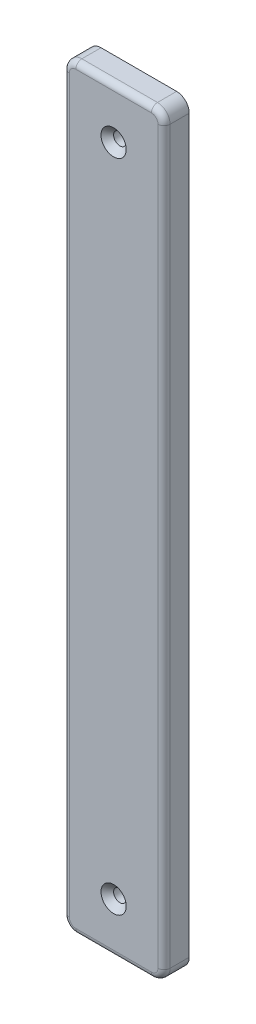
ISO-10303-21;
HEADER;
FILE_DESCRIPTION(('STEP AP214'),'2;1');
FILE_NAME('part.step','',(''),(''),'','','');
FILE_SCHEMA(('AUTOMOTIVE_DESIGN { 1 0 10303 214 1 1 1 1 }'));
ENDSEC;
DATA;
#1=APPLICATION_CONTEXT('core data for automotive mechanical design processes');
#2=APPLICATION_PROTOCOL_DEFINITION('international standard','automotive_design',2000,#1);
#3=PRODUCT_CONTEXT('',#1,'mechanical');
#4=PRODUCT('Part','Part','',(#3));
#5=PRODUCT_RELATED_PRODUCT_CATEGORY('part','',(#4));
#6=PRODUCT_DEFINITION_FORMATION('','',#4);
#7=PRODUCT_DEFINITION_CONTEXT('part definition',#1,'design');
#8=PRODUCT_DEFINITION('design','',#6,#7);
#9=PRODUCT_DEFINITION_SHAPE('','',#8);
#10=(LENGTH_UNIT() NAMED_UNIT(*) SI_UNIT(.MILLI.,.METRE.));
#11=(NAMED_UNIT(*) PLANE_ANGLE_UNIT() SI_UNIT($,.RADIAN.));
#12=(NAMED_UNIT(*) SI_UNIT($,.STERADIAN.) SOLID_ANGLE_UNIT());
#13=UNCERTAINTY_MEASURE_WITH_UNIT(LENGTH_MEASURE(1.E-05),#10,'distance_accuracy_value','');
#14=(GEOMETRIC_REPRESENTATION_CONTEXT(3) GLOBAL_UNCERTAINTY_ASSIGNED_CONTEXT((#13)) GLOBAL_UNIT_ASSIGNED_CONTEXT((#10,
#11,#12)) REPRESENTATION_CONTEXT('',''));
#15=CARTESIAN_POINT('',(0.,0.,0.));
#16=DIRECTION('',(0.,0.,1.));
#17=DIRECTION('',(1.,0.,0.));
#18=AXIS2_PLACEMENT_3D('',#15,#16,#17);
#19=CARTESIAN_POINT('',(25.4,-190.5,12.7));
#20=DIRECTION('',(-1.,0.,0.));
#21=DIRECTION('',(0.,0.,1.));
#22=AXIS2_PLACEMENT_3D('',#19,#20,#21);
#23=PLANE('',#22);
#24=DIRECTION('',(0.,0.,-1.));
#25=VECTOR('',#24,1.);
#26=CARTESIAN_POINT('',(25.4,184.15,12.7));
#27=LINE('',#26,#25);
#28=CARTESIAN_POINT('',(25.4,184.15,0.));
#29=VERTEX_POINT('',#28);
#30=CARTESIAN_POINT('',(25.4,184.15,9.652));
#31=VERTEX_POINT('',#30);
#32=EDGE_CURVE('E138',#29,#31,#27,.F.);
#33=ORIENTED_EDGE('',*,*,#32,.T.);
#34=DIRECTION('',(0.,1.,0.));
#35=VECTOR('',#34,1.);
#36=CARTESIAN_POINT('',(25.4,-190.5,9.652));
#37=LINE('',#36,#35);
#38=CARTESIAN_POINT('',(25.4,-184.15,9.652));
#39=VERTEX_POINT('',#38);
#40=EDGE_CURVE('E134',#31,#39,#37,.F.);
#41=ORIENTED_EDGE('',*,*,#40,.T.);
#42=DIRECTION('',(0.,0.,-1.));
#43=VECTOR('',#42,1.);
#44=CARTESIAN_POINT('',(25.4,-184.15,0.));
#45=LINE('',#44,#43);
#46=CARTESIAN_POINT('',(25.4,-184.15,0.));
#47=VERTEX_POINT('',#46);
#48=EDGE_CURVE('E127',#39,#47,#45,.T.);
#49=ORIENTED_EDGE('',*,*,#48,.T.);
#50=DIRECTION('',(0.,1.,0.));
#51=VECTOR('',#50,1.);
#52=CARTESIAN_POINT('',(25.4,-190.5,0.));
#53=LINE('',#52,#51);
#54=EDGE_CURVE('E131',#47,#29,#53,.T.);
#55=ORIENTED_EDGE('',*,*,#54,.T.);
#56=EDGE_LOOP('',(#33,#41,#49,#55));
#57=FACE_BOUND('',#56,.T.);
#58=ADVANCED_FACE('F36',(#57),#23,.F.);
#59=CARTESIAN_POINT('',(-25.4,190.5,12.7));
#60=DIRECTION('',(0.,1.,0.));
#61=DIRECTION('',(0.,0.,1.));
#62=AXIS2_PLACEMENT_3D('',#59,#60,#61);
#63=PLANE('',#62);
#64=DIRECTION('',(0.,0.,-1.));
#65=VECTOR('',#64,1.);
#66=CARTESIAN_POINT('',(-19.05,190.5,12.7));
#67=LINE('',#66,#65);
#68=CARTESIAN_POINT('',(-19.05,190.5,0.));
#69=VERTEX_POINT('',#68);
#70=CARTESIAN_POINT('',(-19.05,190.5,9.652));
#71=VERTEX_POINT('',#70);
#72=EDGE_CURVE('E198',#69,#71,#67,.F.);
#73=ORIENTED_EDGE('',*,*,#72,.T.);
#74=DIRECTION('',(1.,0.,0.));
#75=VECTOR('',#74,1.);
#76=CARTESIAN_POINT('',(19.05,190.5,9.652));
#77=LINE('',#76,#75);
#78=CARTESIAN_POINT('',(19.05,190.5,9.652));
#79=VERTEX_POINT('',#78);
#80=EDGE_CURVE('E221',#71,#79,#77,.T.);
#81=ORIENTED_EDGE('',*,*,#80,.T.);
#82=DIRECTION('',(0.,0.,-1.));
#83=VECTOR('',#82,1.);
#84=CARTESIAN_POINT('',(19.05,190.5,0.));
#85=LINE('',#84,#83);
#86=CARTESIAN_POINT('',(19.05,190.5,0.));
#87=VERTEX_POINT('',#86);
#88=EDGE_CURVE('E196',#79,#87,#85,.T.);
#89=ORIENTED_EDGE('',*,*,#88,.T.);
#90=DIRECTION('',(1.,0.,0.));
#91=VECTOR('',#90,1.);
#92=CARTESIAN_POINT('',(-25.4,190.5,0.));
#93=LINE('',#92,#91);
#94=EDGE_CURVE('E154',#69,#87,#93,.T.);
#95=ORIENTED_EDGE('',*,*,#94,.F.);
#96=EDGE_LOOP('',(#73,#81,#89,#95));
#97=FACE_BOUND('',#96,.T.);
#98=ADVANCED_FACE('F275',(#97),#63,.T.);
#99=CARTESIAN_POINT('',(-25.4,190.5,12.7));
#100=DIRECTION('',(1.,0.,0.));
#101=DIRECTION('',(0.,0.,-1.));
#102=AXIS2_PLACEMENT_3D('',#99,#100,#101);
#103=PLANE('',#102);
#104=DIRECTION('',(0.,0.,-1.));
#105=VECTOR('',#104,1.);
#106=CARTESIAN_POINT('',(-25.4,-184.15,12.7));
#107=LINE('',#106,#105);
#108=CARTESIAN_POINT('',(-25.4,-184.15,0.));
#109=VERTEX_POINT('',#108);
#110=CARTESIAN_POINT('',(-25.4,-184.15,9.652));
#111=VERTEX_POINT('',#110);
#112=EDGE_CURVE('E194',#109,#111,#107,.F.);
#113=ORIENTED_EDGE('',*,*,#112,.T.);
#114=DIRECTION('',(0.,-1.,0.));
#115=VECTOR('',#114,1.);
#116=CARTESIAN_POINT('',(-25.4,190.5,9.652));
#117=LINE('',#116,#115);
#118=CARTESIAN_POINT('',(-25.4,184.15,9.652));
#119=VERTEX_POINT('',#118);
#120=EDGE_CURVE('E11',#111,#119,#117,.F.);
#121=ORIENTED_EDGE('',*,*,#120,.T.);
#122=DIRECTION('',(0.,0.,-1.));
#123=VECTOR('',#122,1.);
#124=CARTESIAN_POINT('',(-25.4,184.15,0.));
#125=LINE('',#124,#123);
#126=CARTESIAN_POINT('',(-25.4,184.15,0.));
#127=VERTEX_POINT('',#126);
#128=EDGE_CURVE('E192',#119,#127,#125,.T.);
#129=ORIENTED_EDGE('',*,*,#128,.T.);
#130=DIRECTION('',(0.,-1.,0.));
#131=VECTOR('',#130,1.);
#132=CARTESIAN_POINT('',(-25.4,190.5,0.));
#133=LINE('',#132,#131);
#134=EDGE_CURVE('E160',#127,#109,#133,.T.);
#135=ORIENTED_EDGE('',*,*,#134,.T.);
#136=EDGE_LOOP('',(#113,#121,#129,#135));
#137=FACE_BOUND('',#136,.T.);
#138=ADVANCED_FACE('F280',(#137),#103,.F.);
#139=CARTESIAN_POINT('',(25.4,-190.5,12.7));
#140=DIRECTION('',(0.,-1.,0.));
#141=DIRECTION('',(0.,0.,-1.));
#142=AXIS2_PLACEMENT_3D('',#139,#140,#141);
#143=PLANE('',#142);
#144=DIRECTION('',(0.,0.,-1.));
#145=VECTOR('',#144,1.);
#146=CARTESIAN_POINT('',(19.05,-190.5,12.7));
#147=LINE('',#146,#145);
#148=CARTESIAN_POINT('',(19.05,-190.5,0.));
#149=VERTEX_POINT('',#148);
#150=CARTESIAN_POINT('',(19.05,-190.5,9.652));
#151=VERTEX_POINT('',#150);
#152=EDGE_CURVE('E143',#149,#151,#147,.F.);
#153=ORIENTED_EDGE('',*,*,#152,.T.);
#154=DIRECTION('',(-1.,0.,0.));
#155=VECTOR('',#154,1.);
#156=CARTESIAN_POINT('',(-19.05,-190.5,9.652));
#157=LINE('',#156,#155);
#158=CARTESIAN_POINT('',(-19.05,-190.5,9.652));
#159=VERTEX_POINT('',#158);
#160=EDGE_CURVE('E60',#151,#159,#157,.T.);
#161=ORIENTED_EDGE('',*,*,#160,.T.);
#162=DIRECTION('',(0.,0.,-1.));
#163=VECTOR('',#162,1.);
#164=CARTESIAN_POINT('',(-19.05,-190.5,0.));
#165=LINE('',#164,#163);
#166=CARTESIAN_POINT('',(-19.05,-190.5,0.));
#167=VERTEX_POINT('',#166);
#168=EDGE_CURVE('E147',#159,#167,#165,.T.);
#169=ORIENTED_EDGE('',*,*,#168,.T.);
#170=DIRECTION('',(-1.,0.,0.));
#171=VECTOR('',#170,1.);
#172=CARTESIAN_POINT('',(25.4,-190.5,0.));
#173=LINE('',#172,#171);
#174=EDGE_CURVE('E170',#149,#167,#173,.T.);
#175=ORIENTED_EDGE('',*,*,#174,.F.);
#176=EDGE_LOOP('',(#153,#161,#169,#175));
#177=FACE_BOUND('',#176,.T.);
#178=ADVANCED_FACE('F358',(#177),#143,.T.);
#179=CARTESIAN_POINT('',(25.4,190.5,12.7));
#180=DIRECTION('',(0.,0.,-1.));
#181=DIRECTION('',(-1.,0.,0.));
#182=AXIS2_PLACEMENT_3D('',#179,#180,#181);
#183=PLANE('',#182);
#184=DIRECTION('',(1.,0.,0.));
#185=VECTOR('',#184,1.);
#186=CARTESIAN_POINT('',(-19.05,187.452,12.7));
#187=LINE('',#186,#185);
#188=CARTESIAN_POINT('',(19.05,187.452,12.7));
#189=VERTEX_POINT('',#188);
#190=CARTESIAN_POINT('',(-19.05,187.452,12.7));
#191=VERTEX_POINT('',#190);
#192=EDGE_CURVE('E213',#189,#191,#187,.F.);
#193=ORIENTED_EDGE('',*,*,#192,.T.);
#194=CARTESIAN_POINT('',(-19.05,184.15,12.7));
#195=DIRECTION('',(0.,0.,-1.));
#196=DIRECTION('',(-1.,0.,0.));
#197=AXIS2_PLACEMENT_3D('',#194,#195,#196);
#198=CIRCLE('',#197,3.302);
#199=CARTESIAN_POINT('',(-22.352,184.15,12.7));
#200=VERTEX_POINT('',#199);
#201=EDGE_CURVE('E215',#191,#200,#198,.F.);
#202=ORIENTED_EDGE('',*,*,#201,.T.);
#203=DIRECTION('',(0.,-1.,0.));
#204=VECTOR('',#203,1.);
#205=CARTESIAN_POINT('',(-22.352,190.5,12.7));
#206=LINE('',#205,#204);
#207=CARTESIAN_POINT('',(-22.352,-184.15,12.7));
#208=VERTEX_POINT('',#207);
#209=EDGE_CURVE('E201',#200,#208,#206,.T.);
#210=ORIENTED_EDGE('',*,*,#209,.T.);
#211=CARTESIAN_POINT('',(-19.05,-184.15,12.7));
#212=DIRECTION('',(0.,0.,-1.));
#213=DIRECTION('',(-1.,0.,0.));
#214=AXIS2_PLACEMENT_3D('',#211,#212,#213);
#215=CIRCLE('',#214,3.302);
#216=CARTESIAN_POINT('',(-19.05,-187.452,12.7));
#217=VERTEX_POINT('',#216);
#218=EDGE_CURVE('E203',#208,#217,#215,.F.);
#219=ORIENTED_EDGE('',*,*,#218,.T.);
#220=DIRECTION('',(-1.,0.,0.));
#221=VECTOR('',#220,1.);
#222=CARTESIAN_POINT('',(19.05,-187.452,12.7));
#223=LINE('',#222,#221);
#224=CARTESIAN_POINT('',(19.05,-187.452,12.7));
#225=VERTEX_POINT('',#224);
#226=EDGE_CURVE('E205',#217,#225,#223,.F.);
#227=ORIENTED_EDGE('',*,*,#226,.T.);
#228=CARTESIAN_POINT('',(19.05,-184.15,12.7));
#229=DIRECTION('',(0.,0.,-1.));
#230=DIRECTION('',(-1.,0.,0.));
#231=AXIS2_PLACEMENT_3D('',#228,#229,#230);
#232=CIRCLE('',#231,3.302);
#233=CARTESIAN_POINT('',(22.352,-184.15,12.7));
#234=VERTEX_POINT('',#233);
#235=EDGE_CURVE('E207',#225,#234,#232,.F.);
#236=ORIENTED_EDGE('',*,*,#235,.T.);
#237=DIRECTION('',(0.,1.,0.));
#238=VECTOR('',#237,1.);
#239=CARTESIAN_POINT('',(22.352,190.5,12.7));
#240=LINE('',#239,#238);
#241=CARTESIAN_POINT('',(22.352,184.15,12.7));
#242=VERTEX_POINT('',#241);
#243=EDGE_CURVE('E209',#234,#242,#240,.T.);
#244=ORIENTED_EDGE('',*,*,#243,.T.);
#245=CARTESIAN_POINT('',(19.05,184.15,12.7));
#246=DIRECTION('',(0.,0.,-1.));
#247=DIRECTION('',(-1.,0.,0.));
#248=AXIS2_PLACEMENT_3D('',#245,#246,#247);
#249=CIRCLE('',#248,3.302);
#250=EDGE_CURVE('E211',#242,#189,#249,.F.);
#251=ORIENTED_EDGE('',*,*,#250,.T.);
#252=EDGE_LOOP('',(#193,#202,#210,#219,#227,#236,#244,#251));
#253=FACE_BOUND('',#252,.T.);
#254=CARTESIAN_POINT('',(0.,165.1,12.7));
#255=DIRECTION('',(0.,0.,-1.));
#256=DIRECTION('',(-1.,0.,0.));
#257=AXIS2_PLACEMENT_3D('',#254,#255,#256);
#258=CIRCLE('',#257,6.34999999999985);
#259=CARTESIAN_POINT('',(6.3499999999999,165.1,12.7));
#260=VERTEX_POINT('',#259);
#261=EDGE_CURVE('E179',#260,#260,#258,.T.);
#262=ORIENTED_EDGE('',*,*,#261,.T.);
#263=EDGE_LOOP('',(#262));
#264=FACE_BOUND('',#263,.T.);
#265=CARTESIAN_POINT('',(0.,-165.1,12.7));
#266=DIRECTION('',(0.,0.,-1.));
#267=DIRECTION('',(-1.,0.,0.));
#268=AXIS2_PLACEMENT_3D('',#265,#266,#267);
#269=CIRCLE('',#268,6.34999999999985);
#270=CARTESIAN_POINT('',(6.3499999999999,-165.1,12.7));
#271=VERTEX_POINT('',#270);
#272=EDGE_CURVE('E176',#271,#271,#269,.T.);
#273=ORIENTED_EDGE('',*,*,#272,.T.);
#274=EDGE_LOOP('',(#273));
#275=FACE_BOUND('',#274,.T.);
#276=ADVANCED_FACE('F355',(#253,#264,#275),#183,.F.);
#277=CARTESIAN_POINT('',(25.4,190.5,0.));
#278=DIRECTION('',(0.,0.,-1.));
#279=DIRECTION('',(-1.,0.,0.));
#280=AXIS2_PLACEMENT_3D('',#277,#278,#279);
#281=PLANE('',#280);
#282=CARTESIAN_POINT('',(0.,165.1,0.));
#283=DIRECTION('',(0.,0.,1.));
#284=DIRECTION('',(1.,0.,0.));
#285=AXIS2_PLACEMENT_3D('',#282,#283,#284);
#286=CIRCLE('',#285,3.17499999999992);
#287=CARTESIAN_POINT('',(3.17499999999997,165.1,0.));
#288=VERTEX_POINT('',#287);
#289=EDGE_CURVE('E163',#288,#288,#286,.T.);
#290=ORIENTED_EDGE('',*,*,#289,.T.);
#291=EDGE_LOOP('',(#290));
#292=FACE_BOUND('',#291,.T.);
#293=CARTESIAN_POINT('',(0.,-165.1,0.));
#294=DIRECTION('',(0.,0.,1.));
#295=DIRECTION('',(1.,0.,0.));
#296=AXIS2_PLACEMENT_3D('',#293,#294,#295);
#297=CIRCLE('',#296,3.17499999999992);
#298=CARTESIAN_POINT('',(3.17499999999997,-165.1,0.));
#299=VERTEX_POINT('',#298);
#300=EDGE_CURVE('E155',#299,#299,#297,.T.);
#301=ORIENTED_EDGE('',*,*,#300,.T.);
#302=EDGE_LOOP('',(#301));
#303=FACE_BOUND('',#302,.T.);
#304=ORIENTED_EDGE('',*,*,#54,.F.);
#305=CARTESIAN_POINT('',(19.05,-184.15,0.));
#306=DIRECTION('',(0.,0.,-1.));
#307=DIRECTION('',(-1.,0.,0.));
#308=AXIS2_PLACEMENT_3D('',#305,#306,#307);
#309=CIRCLE('',#308,6.35);
#310=EDGE_CURVE('E141',#47,#149,#309,.T.);
#311=ORIENTED_EDGE('',*,*,#310,.T.);
#312=ORIENTED_EDGE('',*,*,#174,.T.);
#313=CARTESIAN_POINT('',(-19.05,-184.15,0.));
#314=DIRECTION('',(0.,0.,-1.));
#315=DIRECTION('',(-1.,0.,0.));
#316=AXIS2_PLACEMENT_3D('',#313,#314,#315);
#317=CIRCLE('',#316,6.35);
#318=EDGE_CURVE('E148',#167,#109,#317,.T.);
#319=ORIENTED_EDGE('',*,*,#318,.T.);
#320=ORIENTED_EDGE('',*,*,#134,.F.);
#321=CARTESIAN_POINT('',(-19.05,184.15,0.));
#322=DIRECTION('',(0.,0.,-1.));
#323=DIRECTION('',(-1.,0.,0.));
#324=AXIS2_PLACEMENT_3D('',#321,#322,#323);
#325=CIRCLE('',#324,6.35);
#326=EDGE_CURVE('E187',#127,#69,#325,.T.);
#327=ORIENTED_EDGE('',*,*,#326,.T.);
#328=ORIENTED_EDGE('',*,*,#94,.T.);
#329=CARTESIAN_POINT('',(19.05,184.15,0.));
#330=DIRECTION('',(0.,0.,-1.));
#331=DIRECTION('',(-1.,0.,0.));
#332=AXIS2_PLACEMENT_3D('',#329,#330,#331);
#333=CIRCLE('',#332,6.35);
#334=EDGE_CURVE('E137',#87,#29,#333,.T.);
#335=ORIENTED_EDGE('',*,*,#334,.T.);
#336=EDGE_LOOP('',(#304,#311,#312,#319,#320,#327,#328,#335));
#337=FACE_BOUND('',#336,.T.);
#338=ADVANCED_FACE('F150',(#292,#303,#337),#281,.T.);
#339=CARTESIAN_POINT('',(0.,-165.1,0.));
#340=DIRECTION('',(0.,0.,1.));
#341=DIRECTION('',(1.,0.,0.));
#342=AXIS2_PLACEMENT_3D('',#339,#340,#341);
#343=CYLINDRICAL_SURFACE('',#342,3.17499999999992);
#344=CARTESIAN_POINT('',(0.,-165.1,9.52500000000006));
#345=DIRECTION('',(0.,0.,-1.));
#346=DIRECTION('',(-1.,0.,0.));
#347=AXIS2_PLACEMENT_3D('',#344,#345,#346);
#348=CIRCLE('',#347,3.17499999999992);
#349=CARTESIAN_POINT('',(3.17499999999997,-165.1,9.52500000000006));
#350=VERTEX_POINT('',#349);
#351=EDGE_CURVE('E182',#350,#350,#348,.F.);
#352=ORIENTED_EDGE('',*,*,#351,.T.);
#353=EDGE_LOOP('',(#352));
#354=FACE_BOUND('',#353,.T.);
#355=ORIENTED_EDGE('',*,*,#300,.F.);
#356=EDGE_LOOP('',(#355));
#357=FACE_BOUND('',#356,.T.);
#358=ADVANCED_FACE('F262',(#354,#357),#343,.F.);
#359=CARTESIAN_POINT('',(0.,165.1,0.));
#360=DIRECTION('',(0.,0.,1.));
#361=DIRECTION('',(1.,0.,0.));
#362=AXIS2_PLACEMENT_3D('',#359,#360,#361);
#363=CYLINDRICAL_SURFACE('',#362,3.17499999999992);
#364=CARTESIAN_POINT('',(0.,165.1,9.52500000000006));
#365=DIRECTION('',(0.,0.,-1.));
#366=DIRECTION('',(-1.,0.,0.));
#367=AXIS2_PLACEMENT_3D('',#364,#365,#366);
#368=CIRCLE('',#367,3.17499999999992);
#369=CARTESIAN_POINT('',(3.17499999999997,165.1,9.52500000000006));
#370=VERTEX_POINT('',#369);
#371=EDGE_CURVE('E173',#370,#370,#368,.F.);
#372=ORIENTED_EDGE('',*,*,#371,.T.);
#373=EDGE_LOOP('',(#372));
#374=FACE_BOUND('',#373,.T.);
#375=ORIENTED_EDGE('',*,*,#289,.F.);
#376=EDGE_LOOP('',(#375));
#377=FACE_BOUND('',#376,.T.);
#378=ADVANCED_FACE('F259',(#374,#377),#363,.F.);
#379=CARTESIAN_POINT('',(0.,165.1,9.52500000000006));
#380=DIRECTION('',(0.,0.,1.));
#381=DIRECTION('',(1.,0.,0.));
#382=AXIS2_PLACEMENT_3D('',#379,#380,#381);
#383=CONICAL_SURFACE('',#382,3.17499999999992,0.785398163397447);
#384=CARTESIAN_POINT('',(6.3499999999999,165.1,12.7));
#385=CARTESIAN_POINT('',(6.31692708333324,165.1,12.6669270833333));
#386=CARTESIAN_POINT('',(6.28385416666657,165.1,12.6338541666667));
#387=CARTESIAN_POINT('',(6.21770833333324,165.1,12.5677083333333));
#388=CARTESIAN_POINT('',(6.18463541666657,165.1,12.5346354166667));
#389=CARTESIAN_POINT('',(6.11848958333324,165.1,12.4684895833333));
#390=CARTESIAN_POINT('',(6.08541666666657,165.1,12.4354166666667));
#391=CARTESIAN_POINT('',(6.01927083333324,165.1,12.3692708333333));
#392=CARTESIAN_POINT('',(5.98619791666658,165.1,12.3361979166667));
#393=CARTESIAN_POINT('',(5.92005208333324,165.1,12.2700520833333));
#394=CARTESIAN_POINT('',(5.88697916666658,165.1,12.2369791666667));
#395=CARTESIAN_POINT('',(5.82083333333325,165.1,12.1708333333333));
#396=CARTESIAN_POINT('',(5.78776041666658,165.1,12.1377604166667));
#397=CARTESIAN_POINT('',(5.72161458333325,165.1,12.0716145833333));
#398=CARTESIAN_POINT('',(5.68854166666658,165.1,12.0385416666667));
#399=CARTESIAN_POINT('',(5.62239583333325,165.1,11.9723958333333));
#400=CARTESIAN_POINT('',(5.58932291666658,165.1,11.9393229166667));
#401=CARTESIAN_POINT('',(5.52317708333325,165.1,11.8731770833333));
#402=CARTESIAN_POINT('',(5.49010416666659,165.1,11.8401041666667));
#403=CARTESIAN_POINT('',(5.42395833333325,165.1,11.7739583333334));
#404=CARTESIAN_POINT('',(5.39088541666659,165.1,11.7408854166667));
#405=CARTESIAN_POINT('',(5.32473958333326,165.1,11.6747395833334));
#406=CARTESIAN_POINT('',(5.29166666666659,165.1,11.6416666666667));
#407=CARTESIAN_POINT('',(5.22552083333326,165.1,11.5755208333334));
#408=CARTESIAN_POINT('',(5.19244791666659,165.1,11.5424479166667));
#409=CARTESIAN_POINT('',(5.12630208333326,165.1,11.4763020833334));
#410=CARTESIAN_POINT('',(5.09322916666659,165.1,11.4432291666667));
#411=CARTESIAN_POINT('',(5.02708333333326,165.1,11.3770833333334));
#412=CARTESIAN_POINT('',(4.9940104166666,165.1,11.3440104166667));
#413=CARTESIAN_POINT('',(4.92786458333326,165.1,11.2778645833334));
#414=CARTESIAN_POINT('',(4.8947916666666,165.1,11.2447916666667));
#415=CARTESIAN_POINT('',(4.82864583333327,165.1,11.1786458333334));
#416=CARTESIAN_POINT('',(4.7955729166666,165.1,11.1455729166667));
#417=CARTESIAN_POINT('',(4.72942708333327,165.1,11.0794270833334));
#418=CARTESIAN_POINT('',(4.6963541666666,165.1,11.0463541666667));
#419=CARTESIAN_POINT('',(4.63020833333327,165.1,10.9802083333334));
#420=CARTESIAN_POINT('',(4.5971354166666,165.1,10.9471354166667));
#421=CARTESIAN_POINT('',(4.53098958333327,165.1,10.8809895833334));
#422=CARTESIAN_POINT('',(4.49791666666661,165.1,10.8479166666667));
#423=CARTESIAN_POINT('',(4.43177083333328,165.1,10.7817708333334));
#424=CARTESIAN_POINT('',(4.39869791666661,165.1,10.7486979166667));
#425=CARTESIAN_POINT('',(4.33255208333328,165.1,10.6825520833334));
#426=CARTESIAN_POINT('',(4.29947916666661,165.1,10.6494791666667));
#427=CARTESIAN_POINT('',(4.23333333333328,165.1,10.5833333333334));
#428=CARTESIAN_POINT('',(4.20026041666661,165.1,10.5502604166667));
#429=CARTESIAN_POINT('',(4.13411458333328,165.1,10.4841145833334));
#430=CARTESIAN_POINT('',(4.10104166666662,165.1,10.4510416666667));
#431=CARTESIAN_POINT('',(4.03489583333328,165.1,10.3848958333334));
#432=CARTESIAN_POINT('',(4.00182291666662,165.1,10.3518229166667));
#433=CARTESIAN_POINT('',(3.93567708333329,165.1,10.2856770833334));
#434=CARTESIAN_POINT('',(3.90260416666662,165.1,10.2526041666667));
#435=CARTESIAN_POINT('',(3.83645833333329,165.1,10.1864583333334));
#436=CARTESIAN_POINT('',(3.80338541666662,165.1,10.1533854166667));
#437=CARTESIAN_POINT('',(3.73723958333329,165.1,10.0872395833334));
#438=CARTESIAN_POINT('',(3.70416666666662,165.1,10.0541666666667));
#439=CARTESIAN_POINT('',(3.63802083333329,165.1,9.98802083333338));
#440=CARTESIAN_POINT('',(3.60494791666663,165.1,9.95494791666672));
#441=CARTESIAN_POINT('',(3.53880208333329,165.1,9.88880208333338));
#442=CARTESIAN_POINT('',(3.50572916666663,165.1,9.85572916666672));
#443=CARTESIAN_POINT('',(3.4395833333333,165.1,9.78958333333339));
#444=CARTESIAN_POINT('',(3.40651041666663,165.1,9.75651041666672));
#445=CARTESIAN_POINT('',(3.3403645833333,165.1,9.69036458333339));
#446=CARTESIAN_POINT('',(3.30729166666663,165.1,9.65729166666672));
#447=CARTESIAN_POINT('',(3.2411458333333,165.1,9.59114583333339));
#448=CARTESIAN_POINT('',(3.20807291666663,165.1,9.55807291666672));
#449=CARTESIAN_POINT('',(3.17499999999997,165.1,9.52500000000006));
#450=B_SPLINE_CURVE_WITH_KNOTS('',3,(#384,#385,#386,#387,#388,#389,#390,#391,#392,#393,#394,
#395,#396,#397,#398,#399,#400,#401,#402,#403,#404,#405,#406,#407,#408,#409,#410,#411,#412,#413,
#414,#415,#416,#417,#418,#419,#420,#421,#422,#423,#424,#425,#426,#427,#428,#429,#430,#431,#432,
#433,#434,#435,#436,#437,#438,#439,#440,#441,#442,#443,#444,#445,#446,#447,#448,#449),
.UNSPECIFIED.,.F.,.F.,(4,2,2,2,2,2,2,2,2,2,2,2,2,2,2,2,2,2,2,2,2,2,2,2,2,2,2,2,2,2,2,2,4),(0.,
0.140316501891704,0.280633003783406,0.420949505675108,0.561266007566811,0.701582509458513,
0.841899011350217,0.98221551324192,1.12253201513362,1.26284851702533,1.40316501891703,
1.54348152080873,1.68379802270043,1.82411452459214,1.96443102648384,2.10474752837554,
2.24506403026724,2.38538053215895,2.52569703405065,2.66601353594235,2.80633003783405,
2.94664653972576,3.08696304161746,3.22727954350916,3.36759604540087,3.50791254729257,
3.64822904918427,3.78854555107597,3.92886205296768,4.06917855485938,4.20949505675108,
4.34981155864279,4.49012806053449),.UNSPECIFIED.);
#451=EDGE_CURVE('BSEAM261',#260,#370,#450,.T.);
#452=ORIENTED_EDGE('',*,*,#261,.F.);
#453=ORIENTED_EDGE('',*,*,#371,.F.);
#454=ORIENTED_EDGE('',*,*,#451,.T.);
#455=ORIENTED_EDGE('',*,*,#451,.F.);
#456=EDGE_LOOP('',(#452,#454,#453,#455));
#457=FACE_BOUND('',#456,.T.);
#458=ADVANCED_FACE('F261',(#457),#383,.F.);
#459=CARTESIAN_POINT('',(0.,-165.1,9.52500000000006));
#460=DIRECTION('',(0.,0.,1.));
#461=DIRECTION('',(1.,0.,0.));
#462=AXIS2_PLACEMENT_3D('',#459,#460,#461);
#463=CONICAL_SURFACE('',#462,3.17499999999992,0.785398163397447);
#464=CARTESIAN_POINT('',(6.3499999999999,-165.1,12.7));
#465=CARTESIAN_POINT('',(6.31692708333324,-165.1,12.6669270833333));
#466=CARTESIAN_POINT('',(6.28385416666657,-165.1,12.6338541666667));
#467=CARTESIAN_POINT('',(6.21770833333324,-165.1,12.5677083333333));
#468=CARTESIAN_POINT('',(6.18463541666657,-165.1,12.5346354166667));
#469=CARTESIAN_POINT('',(6.11848958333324,-165.1,12.4684895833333));
#470=CARTESIAN_POINT('',(6.08541666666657,-165.1,12.4354166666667));
#471=CARTESIAN_POINT('',(6.01927083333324,-165.1,12.3692708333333));
#472=CARTESIAN_POINT('',(5.98619791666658,-165.1,12.3361979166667));
#473=CARTESIAN_POINT('',(5.92005208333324,-165.1,12.2700520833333));
#474=CARTESIAN_POINT('',(5.88697916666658,-165.1,12.2369791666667));
#475=CARTESIAN_POINT('',(5.82083333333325,-165.1,12.1708333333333));
#476=CARTESIAN_POINT('',(5.78776041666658,-165.1,12.1377604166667));
#477=CARTESIAN_POINT('',(5.72161458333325,-165.1,12.0716145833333));
#478=CARTESIAN_POINT('',(5.68854166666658,-165.1,12.0385416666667));
#479=CARTESIAN_POINT('',(5.62239583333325,-165.1,11.9723958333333));
#480=CARTESIAN_POINT('',(5.58932291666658,-165.1,11.9393229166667));
#481=CARTESIAN_POINT('',(5.52317708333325,-165.1,11.8731770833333));
#482=CARTESIAN_POINT('',(5.49010416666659,-165.1,11.8401041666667));
#483=CARTESIAN_POINT('',(5.42395833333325,-165.1,11.7739583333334));
#484=CARTESIAN_POINT('',(5.39088541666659,-165.1,11.7408854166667));
#485=CARTESIAN_POINT('',(5.32473958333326,-165.1,11.6747395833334));
#486=CARTESIAN_POINT('',(5.29166666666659,-165.1,11.6416666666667));
#487=CARTESIAN_POINT('',(5.22552083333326,-165.1,11.5755208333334));
#488=CARTESIAN_POINT('',(5.19244791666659,-165.1,11.5424479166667));
#489=CARTESIAN_POINT('',(5.12630208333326,-165.1,11.4763020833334));
#490=CARTESIAN_POINT('',(5.09322916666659,-165.1,11.4432291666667));
#491=CARTESIAN_POINT('',(5.02708333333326,-165.1,11.3770833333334));
#492=CARTESIAN_POINT('',(4.9940104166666,-165.1,11.3440104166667));
#493=CARTESIAN_POINT('',(4.92786458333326,-165.1,11.2778645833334));
#494=CARTESIAN_POINT('',(4.8947916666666,-165.1,11.2447916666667));
#495=CARTESIAN_POINT('',(4.82864583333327,-165.1,11.1786458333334));
#496=CARTESIAN_POINT('',(4.7955729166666,-165.1,11.1455729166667));
#497=CARTESIAN_POINT('',(4.72942708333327,-165.1,11.0794270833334));
#498=CARTESIAN_POINT('',(4.6963541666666,-165.1,11.0463541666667));
#499=CARTESIAN_POINT('',(4.63020833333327,-165.1,10.9802083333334));
#500=CARTESIAN_POINT('',(4.5971354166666,-165.1,10.9471354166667));
#501=CARTESIAN_POINT('',(4.53098958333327,-165.1,10.8809895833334));
#502=CARTESIAN_POINT('',(4.49791666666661,-165.1,10.8479166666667));
#503=CARTESIAN_POINT('',(4.43177083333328,-165.1,10.7817708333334));
#504=CARTESIAN_POINT('',(4.39869791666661,-165.1,10.7486979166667));
#505=CARTESIAN_POINT('',(4.33255208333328,-165.1,10.6825520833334));
#506=CARTESIAN_POINT('',(4.29947916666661,-165.1,10.6494791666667));
#507=CARTESIAN_POINT('',(4.23333333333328,-165.1,10.5833333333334));
#508=CARTESIAN_POINT('',(4.20026041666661,-165.1,10.5502604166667));
#509=CARTESIAN_POINT('',(4.13411458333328,-165.1,10.4841145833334));
#510=CARTESIAN_POINT('',(4.10104166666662,-165.1,10.4510416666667));
#511=CARTESIAN_POINT('',(4.03489583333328,-165.1,10.3848958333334));
#512=CARTESIAN_POINT('',(4.00182291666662,-165.1,10.3518229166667));
#513=CARTESIAN_POINT('',(3.93567708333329,-165.1,10.2856770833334));
#514=CARTESIAN_POINT('',(3.90260416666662,-165.1,10.2526041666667));
#515=CARTESIAN_POINT('',(3.83645833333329,-165.1,10.1864583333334));
#516=CARTESIAN_POINT('',(3.80338541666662,-165.1,10.1533854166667));
#517=CARTESIAN_POINT('',(3.73723958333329,-165.1,10.0872395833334));
#518=CARTESIAN_POINT('',(3.70416666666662,-165.1,10.0541666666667));
#519=CARTESIAN_POINT('',(3.63802083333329,-165.1,9.98802083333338));
#520=CARTESIAN_POINT('',(3.60494791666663,-165.1,9.95494791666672));
#521=CARTESIAN_POINT('',(3.53880208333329,-165.1,9.88880208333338));
#522=CARTESIAN_POINT('',(3.50572916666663,-165.1,9.85572916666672));
#523=CARTESIAN_POINT('',(3.4395833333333,-165.1,9.78958333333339));
#524=CARTESIAN_POINT('',(3.40651041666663,-165.1,9.75651041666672));
#525=CARTESIAN_POINT('',(3.3403645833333,-165.1,9.69036458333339));
#526=CARTESIAN_POINT('',(3.30729166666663,-165.1,9.65729166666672));
#527=CARTESIAN_POINT('',(3.2411458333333,-165.1,9.59114583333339));
#528=CARTESIAN_POINT('',(3.20807291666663,-165.1,9.55807291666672));
#529=CARTESIAN_POINT('',(3.17499999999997,-165.1,9.52500000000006));
#530=B_SPLINE_CURVE_WITH_KNOTS('',3,(#464,#465,#466,#467,#468,#469,#470,#471,#472,#473,#474,
#475,#476,#477,#478,#479,#480,#481,#482,#483,#484,#485,#486,#487,#488,#489,#490,#491,#492,#493,
#494,#495,#496,#497,#498,#499,#500,#501,#502,#503,#504,#505,#506,#507,#508,#509,#510,#511,#512,
#513,#514,#515,#516,#517,#518,#519,#520,#521,#522,#523,#524,#525,#526,#527,#528,#529),
.UNSPECIFIED.,.F.,.F.,(4,2,2,2,2,2,2,2,2,2,2,2,2,2,2,2,2,2,2,2,2,2,2,2,2,2,2,2,2,2,2,2,4),(0.,
0.140316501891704,0.280633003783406,0.420949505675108,0.561266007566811,0.701582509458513,
0.841899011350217,0.98221551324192,1.12253201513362,1.26284851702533,1.40316501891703,
1.54348152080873,1.68379802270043,1.82411452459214,1.96443102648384,2.10474752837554,
2.24506403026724,2.38538053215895,2.52569703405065,2.66601353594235,2.80633003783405,
2.94664653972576,3.08696304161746,3.22727954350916,3.36759604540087,3.50791254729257,
3.64822904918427,3.78854555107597,3.92886205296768,4.06917855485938,4.20949505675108,
4.34981155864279,4.49012806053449),.UNSPECIFIED.);
#531=EDGE_CURVE('BSEAM269',#271,#350,#530,.T.);
#532=ORIENTED_EDGE('',*,*,#272,.F.);
#533=ORIENTED_EDGE('',*,*,#351,.F.);
#534=ORIENTED_EDGE('',*,*,#531,.T.);
#535=ORIENTED_EDGE('',*,*,#531,.F.);
#536=EDGE_LOOP('',(#532,#534,#533,#535));
#537=FACE_BOUND('',#536,.T.);
#538=ADVANCED_FACE('F269',(#537),#463,.F.);
#539=CARTESIAN_POINT('',(19.05,-184.15,12.7));
#540=DIRECTION('',(0.,0.,1.));
#541=DIRECTION('',(1.,0.,0.));
#542=AXIS2_PLACEMENT_3D('',#539,#540,#541);
#543=CYLINDRICAL_SURFACE('',#542,6.35);
#544=ORIENTED_EDGE('',*,*,#48,.F.);
#545=CARTESIAN_POINT('',(19.05,-184.15,9.652));
#546=DIRECTION('',(0.,0.,-1.));
#547=DIRECTION('',(-1.,0.,0.));
#548=AXIS2_PLACEMENT_3D('',#545,#546,#547);
#549=CIRCLE('',#548,6.35);
#550=EDGE_CURVE('E226',#39,#151,#549,.T.);
#551=ORIENTED_EDGE('',*,*,#550,.T.);
#552=ORIENTED_EDGE('',*,*,#152,.F.);
#553=ORIENTED_EDGE('',*,*,#310,.F.);
#554=EDGE_LOOP('',(#544,#551,#552,#553));
#555=FACE_BOUND('',#554,.T.);
#556=ADVANCED_FACE('F142',(#555),#543,.T.);
#557=CARTESIAN_POINT('',(-19.05,-184.15,12.7));
#558=DIRECTION('',(0.,0.,1.));
#559=DIRECTION('',(1.,0.,0.));
#560=AXIS2_PLACEMENT_3D('',#557,#558,#559);
#561=CYLINDRICAL_SURFACE('',#560,6.35);
#562=ORIENTED_EDGE('',*,*,#168,.F.);
#563=CARTESIAN_POINT('',(-19.05,-184.15,9.652));
#564=DIRECTION('',(0.,0.,-1.));
#565=DIRECTION('',(-1.,0.,0.));
#566=AXIS2_PLACEMENT_3D('',#563,#564,#565);
#567=CIRCLE('',#566,6.35);
#568=EDGE_CURVE('E45',#159,#111,#567,.T.);
#569=ORIENTED_EDGE('',*,*,#568,.T.);
#570=ORIENTED_EDGE('',*,*,#112,.F.);
#571=ORIENTED_EDGE('',*,*,#318,.F.);
#572=EDGE_LOOP('',(#562,#569,#570,#571));
#573=FACE_BOUND('',#572,.T.);
#574=ADVANCED_FACE('F290',(#573),#561,.T.);
#575=CARTESIAN_POINT('',(-19.05,184.15,12.7));
#576=DIRECTION('',(0.,0.,1.));
#577=DIRECTION('',(1.,0.,0.));
#578=AXIS2_PLACEMENT_3D('',#575,#576,#577);
#579=CYLINDRICAL_SURFACE('',#578,6.35);
#580=ORIENTED_EDGE('',*,*,#128,.F.);
#581=CARTESIAN_POINT('',(-19.05,184.15,9.652));
#582=DIRECTION('',(0.,0.,-1.));
#583=DIRECTION('',(-1.,0.,0.));
#584=AXIS2_PLACEMENT_3D('',#581,#582,#583);
#585=CIRCLE('',#584,6.35);
#586=EDGE_CURVE('E218',#119,#71,#585,.T.);
#587=ORIENTED_EDGE('',*,*,#586,.T.);
#588=ORIENTED_EDGE('',*,*,#72,.F.);
#589=ORIENTED_EDGE('',*,*,#326,.F.);
#590=EDGE_LOOP('',(#580,#587,#588,#589));
#591=FACE_BOUND('',#590,.T.);
#592=ADVANCED_FACE('F293',(#591),#579,.T.);
#593=CARTESIAN_POINT('',(19.05,184.15,12.7));
#594=DIRECTION('',(0.,0.,1.));
#595=DIRECTION('',(1.,0.,0.));
#596=AXIS2_PLACEMENT_3D('',#593,#594,#595);
#597=CYLINDRICAL_SURFACE('',#596,6.35);
#598=ORIENTED_EDGE('',*,*,#88,.F.);
#599=CARTESIAN_POINT('',(19.05,184.15,9.652));
#600=DIRECTION('',(0.,0.,-1.));
#601=DIRECTION('',(-1.,0.,0.));
#602=AXIS2_PLACEMENT_3D('',#599,#600,#601);
#603=CIRCLE('',#602,6.35);
#604=EDGE_CURVE('E223',#79,#31,#603,.T.);
#605=ORIENTED_EDGE('',*,*,#604,.T.);
#606=ORIENTED_EDGE('',*,*,#32,.F.);
#607=ORIENTED_EDGE('',*,*,#334,.F.);
#608=EDGE_LOOP('',(#598,#605,#606,#607));
#609=FACE_BOUND('',#608,.T.);
#610=ADVANCED_FACE('F296',(#609),#597,.T.);
#611=CARTESIAN_POINT('',(19.05,-184.15,9.652));
#612=DIRECTION('',(0.,0.,-1.));
#613=DIRECTION('',(-1.,0.,0.));
#614=AXIS2_PLACEMENT_3D('',#611,#612,#613);
#615=TOROIDAL_SURFACE('',#614,3.302,3.048);
#616=CARTESIAN_POINT('',(19.05,-187.452,9.652));
#617=DIRECTION('',(-1.,0.,0.));
#618=DIRECTION('',(0.,0.,1.));
#619=AXIS2_PLACEMENT_3D('',#616,#617,#618);
#620=CIRCLE('',#619,3.048);
#621=EDGE_CURVE('E245',#151,#225,#620,.T.);
#622=ORIENTED_EDGE('',*,*,#621,.F.);
#623=ORIENTED_EDGE('',*,*,#550,.F.);
#624=CARTESIAN_POINT('',(22.352,-184.15,9.652));
#625=DIRECTION('',(0.,1.,0.));
#626=DIRECTION('',(0.,0.,1.));
#627=AXIS2_PLACEMENT_3D('',#624,#625,#626);
#628=CIRCLE('',#627,3.048);
#629=EDGE_CURVE('E40',#234,#39,#628,.T.);
#630=ORIENTED_EDGE('',*,*,#629,.F.);
#631=ORIENTED_EDGE('',*,*,#235,.F.);
#632=EDGE_LOOP('',(#622,#623,#630,#631));
#633=FACE_BOUND('',#632,.T.);
#634=ADVANCED_FACE('F38',(#633),#615,.T.);
#635=CARTESIAN_POINT('',(22.352,190.5,9.652));
#636=DIRECTION('',(0.,1.,0.));
#637=DIRECTION('',(0.,0.,1.));
#638=AXIS2_PLACEMENT_3D('',#635,#636,#637);
#639=CYLINDRICAL_SURFACE('',#638,3.048);
#640=ORIENTED_EDGE('',*,*,#629,.T.);
#641=ORIENTED_EDGE('',*,*,#40,.F.);
#642=CARTESIAN_POINT('',(22.352,184.15,9.652));
#643=DIRECTION('',(0.,1.,0.));
#644=DIRECTION('',(0.,0.,1.));
#645=AXIS2_PLACEMENT_3D('',#642,#643,#644);
#646=CIRCLE('',#645,3.048);
#647=EDGE_CURVE('E243',#242,#31,#646,.T.);
#648=ORIENTED_EDGE('',*,*,#647,.F.);
#649=ORIENTED_EDGE('',*,*,#243,.F.);
#650=EDGE_LOOP('',(#640,#641,#648,#649));
#651=FACE_BOUND('',#650,.T.);
#652=ADVANCED_FACE('F323',(#651),#639,.T.);
#653=CARTESIAN_POINT('',(25.4,-187.452,9.652));
#654=DIRECTION('',(1.,0.,0.));
#655=DIRECTION('',(0.,0.,-1.));
#656=AXIS2_PLACEMENT_3D('',#653,#654,#655);
#657=CYLINDRICAL_SURFACE('',#656,3.048);
#658=ORIENTED_EDGE('',*,*,#621,.T.);
#659=ORIENTED_EDGE('',*,*,#226,.F.);
#660=CARTESIAN_POINT('',(-19.05,-187.452,9.652));
#661=DIRECTION('',(-1.,0.,0.));
#662=DIRECTION('',(0.,0.,1.));
#663=AXIS2_PLACEMENT_3D('',#660,#661,#662);
#664=CIRCLE('',#663,3.048);
#665=EDGE_CURVE('E240',#159,#217,#664,.T.);
#666=ORIENTED_EDGE('',*,*,#665,.F.);
#667=ORIENTED_EDGE('',*,*,#160,.F.);
#668=EDGE_LOOP('',(#658,#659,#666,#667));
#669=FACE_BOUND('',#668,.T.);
#670=ADVANCED_FACE('F320',(#669),#657,.T.);
#671=CARTESIAN_POINT('',(19.05,184.15,9.652));
#672=DIRECTION('',(0.,0.,-1.));
#673=DIRECTION('',(-1.,0.,0.));
#674=AXIS2_PLACEMENT_3D('',#671,#672,#673);
#675=TOROIDAL_SURFACE('',#674,3.302,3.048);
#676=ORIENTED_EDGE('',*,*,#647,.T.);
#677=ORIENTED_EDGE('',*,*,#604,.F.);
#678=CARTESIAN_POINT('',(19.05,187.452,9.652));
#679=DIRECTION('',(-1.,0.,0.));
#680=DIRECTION('',(0.,0.,1.));
#681=AXIS2_PLACEMENT_3D('',#678,#679,#680);
#682=CIRCLE('',#681,3.048);
#683=EDGE_CURVE('E237',#189,#79,#682,.T.);
#684=ORIENTED_EDGE('',*,*,#683,.F.);
#685=ORIENTED_EDGE('',*,*,#250,.F.);
#686=EDGE_LOOP('',(#676,#677,#684,#685));
#687=FACE_BOUND('',#686,.T.);
#688=ADVANCED_FACE('F316',(#687),#675,.T.);
#689=CARTESIAN_POINT('',(-19.05,-184.15,9.652));
#690=DIRECTION('',(0.,0.,-1.));
#691=DIRECTION('',(-1.,0.,0.));
#692=AXIS2_PLACEMENT_3D('',#689,#690,#691);
#693=TOROIDAL_SURFACE('',#692,3.302,3.048);
#694=ORIENTED_EDGE('',*,*,#665,.T.);
#695=ORIENTED_EDGE('',*,*,#218,.F.);
#696=CARTESIAN_POINT('',(-22.352,-184.15,9.652));
#697=DIRECTION('',(0.,1.,0.));
#698=DIRECTION('',(0.,0.,1.));
#699=AXIS2_PLACEMENT_3D('',#696,#697,#698);
#700=CIRCLE('',#699,3.048);
#701=EDGE_CURVE('E234',#111,#208,#700,.T.);
#702=ORIENTED_EDGE('',*,*,#701,.F.);
#703=ORIENTED_EDGE('',*,*,#568,.F.);
#704=EDGE_LOOP('',(#694,#695,#702,#703));
#705=FACE_BOUND('',#704,.T.);
#706=ADVANCED_FACE('F312',(#705),#693,.T.);
#707=CARTESIAN_POINT('',(-25.4,187.452,9.652));
#708=DIRECTION('',(-1.,0.,0.));
#709=DIRECTION('',(0.,0.,1.));
#710=AXIS2_PLACEMENT_3D('',#707,#708,#709);
#711=CYLINDRICAL_SURFACE('',#710,3.048);
#712=ORIENTED_EDGE('',*,*,#683,.T.);
#713=ORIENTED_EDGE('',*,*,#80,.F.);
#714=CARTESIAN_POINT('',(-19.05,187.452,9.652));
#715=DIRECTION('',(-1.,0.,0.));
#716=DIRECTION('',(0.,0.,1.));
#717=AXIS2_PLACEMENT_3D('',#714,#715,#716);
#718=CIRCLE('',#717,3.048);
#719=EDGE_CURVE('E232',#191,#71,#718,.T.);
#720=ORIENTED_EDGE('',*,*,#719,.F.);
#721=ORIENTED_EDGE('',*,*,#192,.F.);
#722=EDGE_LOOP('',(#712,#713,#720,#721));
#723=FACE_BOUND('',#722,.T.);
#724=ADVANCED_FACE('F308',(#723),#711,.T.);
#725=CARTESIAN_POINT('',(-22.352,190.5,9.652));
#726=DIRECTION('',(0.,-1.,0.));
#727=DIRECTION('',(0.,0.,-1.));
#728=AXIS2_PLACEMENT_3D('',#725,#726,#727);
#729=CYLINDRICAL_SURFACE('',#728,3.048);
#730=ORIENTED_EDGE('',*,*,#701,.T.);
#731=ORIENTED_EDGE('',*,*,#209,.F.);
#732=CARTESIAN_POINT('',(-22.352,184.15,9.652));
#733=DIRECTION('',(0.,1.,0.));
#734=DIRECTION('',(0.,0.,1.));
#735=AXIS2_PLACEMENT_3D('',#732,#733,#734);
#736=CIRCLE('',#735,3.048);
#737=EDGE_CURVE('E230',#119,#200,#736,.T.);
#738=ORIENTED_EDGE('',*,*,#737,.F.);
#739=ORIENTED_EDGE('',*,*,#120,.F.);
#740=EDGE_LOOP('',(#730,#731,#738,#739));
#741=FACE_BOUND('',#740,.T.);
#742=ADVANCED_FACE('F304',(#741),#729,.T.);
#743=CARTESIAN_POINT('',(-19.05,184.15,9.652));
#744=DIRECTION('',(0.,0.,-1.));
#745=DIRECTION('',(-1.,0.,0.));
#746=AXIS2_PLACEMENT_3D('',#743,#744,#745);
#747=TOROIDAL_SURFACE('',#746,3.302,3.048);
#748=ORIENTED_EDGE('',*,*,#719,.T.);
#749=ORIENTED_EDGE('',*,*,#586,.F.);
#750=ORIENTED_EDGE('',*,*,#737,.T.);
#751=ORIENTED_EDGE('',*,*,#201,.F.);
#752=EDGE_LOOP('',(#748,#749,#750,#751));
#753=FACE_BOUND('',#752,.T.);
#754=ADVANCED_FACE('F301',(#753),#747,.T.);
#755=CLOSED_SHELL('',(#58,#98,#138,#178,#276,#338,#358,#378,#458,#538,#556,#574,#592,#610,#634,
#652,#670,#688,#706,#724,#742,#754));
#756=MANIFOLD_SOLID_BREP('B2',#755);
#757=ADVANCED_BREP_SHAPE_REPRESENTATION('',(#18,#756),#14);
#758=SHAPE_DEFINITION_REPRESENTATION(#9,#757);
ENDSEC;
END-ISO-10303-21;
